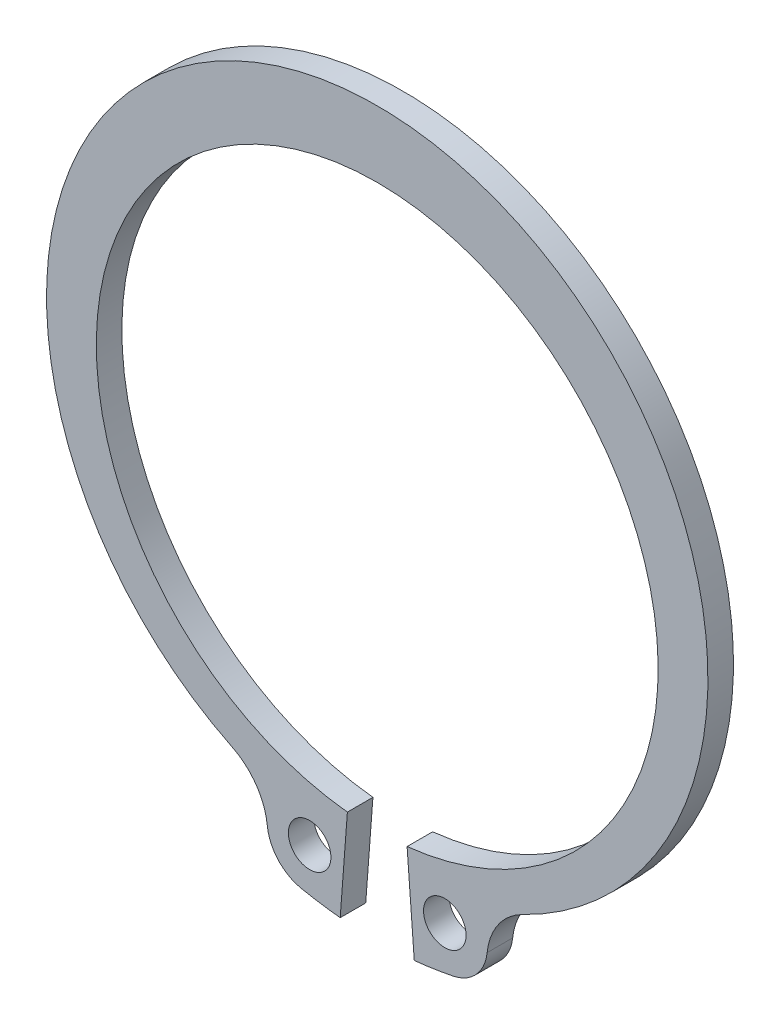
ISO-10303-21;
HEADER;
FILE_DESCRIPTION(('STEP AP214'),'2;1');
FILE_NAME('part.step','',(''),(''),'','','');
FILE_SCHEMA(('AUTOMOTIVE_DESIGN { 1 0 10303 214 1 1 1 1 }'));
ENDSEC;
DATA;
#1=APPLICATION_CONTEXT('core data for automotive mechanical design processes');
#2=APPLICATION_PROTOCOL_DEFINITION('international standard','automotive_design',2000,#1);
#3=PRODUCT_CONTEXT('',#1,'mechanical');
#4=PRODUCT('Part','Part','',(#3));
#5=PRODUCT_RELATED_PRODUCT_CATEGORY('part','',(#4));
#6=PRODUCT_DEFINITION_FORMATION('','',#4);
#7=PRODUCT_DEFINITION_CONTEXT('part definition',#1,'design');
#8=PRODUCT_DEFINITION('design','',#6,#7);
#9=PRODUCT_DEFINITION_SHAPE('','',#8);
#10=(LENGTH_UNIT() NAMED_UNIT(*) SI_UNIT(.MILLI.,.METRE.));
#11=(NAMED_UNIT(*) PLANE_ANGLE_UNIT() SI_UNIT($,.RADIAN.));
#12=(NAMED_UNIT(*) SI_UNIT($,.STERADIAN.) SOLID_ANGLE_UNIT());
#13=UNCERTAINTY_MEASURE_WITH_UNIT(LENGTH_MEASURE(1.E-05),#10,'distance_accuracy_value','');
#14=(GEOMETRIC_REPRESENTATION_CONTEXT(3) GLOBAL_UNCERTAINTY_ASSIGNED_CONTEXT((#13)) GLOBAL_UNIT_ASSIGNED_CONTEXT((#10,
#11,#12)) REPRESENTATION_CONTEXT('',''));
#15=CARTESIAN_POINT('',(0.,0.,0.));
#16=DIRECTION('',(0.,0.,1.));
#17=DIRECTION('',(1.,0.,0.));
#18=AXIS2_PLACEMENT_3D('',#15,#16,#17);
#19=CARTESIAN_POINT('',(0.,0.,1.5));
#20=DIRECTION('',(0.,0.,1.));
#21=DIRECTION('',(1.,0.,0.));
#22=AXIS2_PLACEMENT_3D('',#19,#20,#21);
#23=PLANE('',#22);
#24=CARTESIAN_POINT('',(-3.96952179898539,-19.1917649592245,1.5));
#25=DIRECTION('',(0.,0.,1.));
#26=DIRECTION('',(-1.,0.,0.));
#27=AXIS2_PLACEMENT_3D('',#24,#25,#26);
#28=CIRCLE('',#27,1.25);
#29=CARTESIAN_POINT('',(-5.21952179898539,-19.1917649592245,1.5));
#30=VERTEX_POINT('',#29);
#31=EDGE_CURVE('E145',#30,#30,#28,.T.);
#32=ORIENTED_EDGE('',*,*,#31,.F.);
#33=EDGE_LOOP('',(#32));
#34=FACE_BOUND('',#33,.T.);
#35=CARTESIAN_POINT('',(0.,0.,1.5));
#36=DIRECTION('',(0.,0.,-1.));
#37=DIRECTION('',(1.,0.,0.));
#38=AXIS2_PLACEMENT_3D('',#35,#36,#37);
#39=CIRCLE('',#38,16.5);
#40=CARTESIAN_POINT('',(-1.75340050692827,-16.4065714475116,1.5));
#41=VERTEX_POINT('',#40);
#42=CARTESIAN_POINT('',(1.75340050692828,-16.4065714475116,1.5));
#43=VERTEX_POINT('',#42);
#44=EDGE_CURVE('E160',#41,#43,#39,.T.);
#45=ORIENTED_EDGE('',*,*,#44,.T.);
#46=DIRECTION('',(0.075335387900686,-0.997158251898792,0.));
#47=VECTOR('',#46,1.);
#48=CARTESIAN_POINT('',(1.75340050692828,-16.4065714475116,1.5));
#49=LINE('',#48,#47);
#50=CARTESIAN_POINT('',(2.17527867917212,-21.9906576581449,1.5));
#51=VERTEX_POINT('',#50);
#52=EDGE_CURVE('E98',#43,#51,#49,.T.);
#53=ORIENTED_EDGE('',*,*,#52,.T.);
#54=CARTESIAN_POINT('',(0.,0.,1.5));
#55=DIRECTION('',(0.,0.,1.));
#56=DIRECTION('',(1.,0.,0.));
#57=AXIS2_PLACEMENT_3D('',#54,#55,#56);
#58=CIRCLE('',#57,22.0979832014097);
#59=CARTESIAN_POINT('',(4.47589045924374,-21.6399460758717,1.5));
#60=VERTEX_POINT('',#59);
#61=EDGE_CURVE('E181',#51,#60,#58,.T.);
#62=ORIENTED_EDGE('',*,*,#61,.T.);
#63=CARTESIAN_POINT('',(3.9695217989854,-19.1917649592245,1.5));
#64=DIRECTION('',(0.,0.,1.));
#65=DIRECTION('',(1.,0.,0.));
#66=AXIS2_PLACEMENT_3D('',#63,#64,#65);
#67=CIRCLE('',#66,2.5);
#68=CARTESIAN_POINT('',(6.45596941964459,-19.4517230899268,1.5));
#69=VERTEX_POINT('',#68);
#70=EDGE_CURVE('E200',#60,#69,#67,.T.);
#71=ORIENTED_EDGE('',*,*,#70,.T.);
#72=CARTESIAN_POINT('',(10.1856408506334,-19.8416602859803,1.5));
#73=DIRECTION('',(0.,0.,-1.));
#74=DIRECTION('',(1.,0.,0.));
#75=AXIS2_PLACEMENT_3D('',#72,#73,#74);
#76=CIRCLE('',#75,3.75);
#77=CARTESIAN_POINT('',(8.53747890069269,-16.4732686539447,1.5));
#78=VERTEX_POINT('',#77);
#79=EDGE_CURVE('E197',#69,#78,#76,.T.);
#80=ORIENTED_EDGE('',*,*,#79,.T.);
#81=CARTESIAN_POINT('',(0.,0.975,1.5));
#82=DIRECTION('',(0.,0.,1.));
#83=DIRECTION('',(1.,0.,0.));
#84=AXIS2_PLACEMENT_3D('',#81,#82,#83);
#85=CIRCLE('',#84,19.425);
#86=CARTESIAN_POINT('',(-8.53747890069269,-16.4732686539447,1.5));
#87=VERTEX_POINT('',#86);
#88=EDGE_CURVE('E199',#78,#87,#85,.T.);
#89=ORIENTED_EDGE('',*,*,#88,.T.);
#90=CARTESIAN_POINT('',(-10.1856408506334,-19.8416602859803,1.5));
#91=DIRECTION('',(0.,0.,-1.));
#92=DIRECTION('',(-1.,0.,0.));
#93=AXIS2_PLACEMENT_3D('',#90,#91,#92);
#94=CIRCLE('',#93,3.75);
#95=CARTESIAN_POINT('',(-6.45596941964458,-19.4517230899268,1.5));
#96=VERTEX_POINT('',#95);
#97=EDGE_CURVE('E123',#87,#96,#94,.T.);
#98=ORIENTED_EDGE('',*,*,#97,.T.);
#99=CARTESIAN_POINT('',(-3.96952179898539,-19.1917649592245,1.5));
#100=DIRECTION('',(0.,0.,1.));
#101=DIRECTION('',(-1.,0.,0.));
#102=AXIS2_PLACEMENT_3D('',#99,#100,#101);
#103=CIRCLE('',#102,2.5);
#104=CARTESIAN_POINT('',(-4.47589045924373,-21.6399460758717,1.5));
#105=VERTEX_POINT('',#104);
#106=EDGE_CURVE('E117',#96,#105,#103,.T.);
#107=ORIENTED_EDGE('',*,*,#106,.T.);
#108=CARTESIAN_POINT('',(0.,0.,1.5));
#109=DIRECTION('',(0.,0.,1.));
#110=DIRECTION('',(-1.,0.,0.));
#111=AXIS2_PLACEMENT_3D('',#108,#109,#110);
#112=CIRCLE('',#111,22.0979832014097);
#113=CARTESIAN_POINT('',(-2.17527867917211,-21.9906576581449,1.5));
#114=VERTEX_POINT('',#113);
#115=EDGE_CURVE('E121',#105,#114,#112,.T.);
#116=ORIENTED_EDGE('',*,*,#115,.T.);
#117=DIRECTION('',(0.0753353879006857,0.997158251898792,0.));
#118=VECTOR('',#117,1.);
#119=CARTESIAN_POINT('',(-1.75340050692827,-16.4065714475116,1.5));
#120=LINE('',#119,#118);
#121=EDGE_CURVE('E49',#114,#41,#120,.T.);
#122=ORIENTED_EDGE('',*,*,#121,.T.);
#123=EDGE_LOOP('',(#45,#53,#62,#71,#80,#89,#98,#107,#116,#122));
#124=FACE_BOUND('',#123,.T.);
#125=CARTESIAN_POINT('',(3.9695217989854,-19.1917649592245,1.5));
#126=DIRECTION('',(0.,0.,1.));
#127=DIRECTION('',(1.,0.,0.));
#128=AXIS2_PLACEMENT_3D('',#125,#126,#127);
#129=CIRCLE('',#128,1.25);
#130=CARTESIAN_POINT('',(5.2195217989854,-19.1917649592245,1.5));
#131=VERTEX_POINT('',#130);
#132=EDGE_CURVE('E211',#131,#131,#129,.T.);
#133=ORIENTED_EDGE('',*,*,#132,.F.);
#134=EDGE_LOOP('',(#133));
#135=FACE_BOUND('',#134,.T.);
#136=ADVANCED_FACE('F32',(#34,#124,#135),#23,.T.);
#137=CARTESIAN_POINT('',(0.,0.,0.));
#138=DIRECTION('',(0.,0.,1.));
#139=DIRECTION('',(1.,0.,0.));
#140=AXIS2_PLACEMENT_3D('',#137,#138,#139);
#141=PLANE('',#140);
#142=CARTESIAN_POINT('',(-3.96952179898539,-19.1917649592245,0.));
#143=DIRECTION('',(0.,0.,1.));
#144=DIRECTION('',(-1.,0.,0.));
#145=AXIS2_PLACEMENT_3D('',#142,#143,#144);
#146=CIRCLE('',#145,1.25);
#147=CARTESIAN_POINT('',(-5.21952179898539,-19.1917649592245,0.));
#148=VERTEX_POINT('',#147);
#149=EDGE_CURVE('E208',#148,#148,#146,.T.);
#150=ORIENTED_EDGE('',*,*,#149,.T.);
#151=EDGE_LOOP('',(#150));
#152=FACE_BOUND('',#151,.T.);
#153=CARTESIAN_POINT('',(0.,0.,0.));
#154=DIRECTION('',(0.,0.,-1.));
#155=DIRECTION('',(1.,0.,0.));
#156=AXIS2_PLACEMENT_3D('',#153,#154,#155);
#157=CIRCLE('',#156,16.5);
#158=CARTESIAN_POINT('',(-1.75340050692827,-16.4065714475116,0.));
#159=VERTEX_POINT('',#158);
#160=CARTESIAN_POINT('',(1.75340050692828,-16.4065714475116,0.));
#161=VERTEX_POINT('',#160);
#162=EDGE_CURVE('E141',#159,#161,#157,.T.);
#163=ORIENTED_EDGE('',*,*,#162,.F.);
#164=DIRECTION('',(0.0753353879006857,0.997158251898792,0.));
#165=VECTOR('',#164,1.);
#166=CARTESIAN_POINT('',(-1.75340050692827,-16.4065714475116,0.));
#167=LINE('',#166,#165);
#168=CARTESIAN_POINT('',(-2.17527867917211,-21.9906576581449,0.));
#169=VERTEX_POINT('',#168);
#170=EDGE_CURVE('E90',#169,#159,#167,.T.);
#171=ORIENTED_EDGE('',*,*,#170,.F.);
#172=CARTESIAN_POINT('',(0.,0.,0.));
#173=DIRECTION('',(0.,0.,1.));
#174=DIRECTION('',(-1.,0.,0.));
#175=AXIS2_PLACEMENT_3D('',#172,#173,#174);
#176=CIRCLE('',#175,22.0979832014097);
#177=CARTESIAN_POINT('',(-4.47589045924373,-21.6399460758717,0.));
#178=VERTEX_POINT('',#177);
#179=EDGE_CURVE('E84',#178,#169,#176,.T.);
#180=ORIENTED_EDGE('',*,*,#179,.F.);
#181=CARTESIAN_POINT('',(-3.96952179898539,-19.1917649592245,0.));
#182=DIRECTION('',(0.,0.,1.));
#183=DIRECTION('',(-1.,0.,0.));
#184=AXIS2_PLACEMENT_3D('',#181,#182,#183);
#185=CIRCLE('',#184,2.5);
#186=CARTESIAN_POINT('',(-6.45596941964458,-19.4517230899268,0.));
#187=VERTEX_POINT('',#186);
#188=EDGE_CURVE('E131',#187,#178,#185,.T.);
#189=ORIENTED_EDGE('',*,*,#188,.F.);
#190=CARTESIAN_POINT('',(-10.1856408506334,-19.8416602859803,0.));
#191=DIRECTION('',(0.,0.,-1.));
#192=DIRECTION('',(-1.,0.,0.));
#193=AXIS2_PLACEMENT_3D('',#190,#191,#192);
#194=CIRCLE('',#193,3.75);
#195=CARTESIAN_POINT('',(-8.53747890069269,-16.4732686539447,0.));
#196=VERTEX_POINT('',#195);
#197=EDGE_CURVE('E155',#196,#187,#194,.T.);
#198=ORIENTED_EDGE('',*,*,#197,.F.);
#199=CARTESIAN_POINT('',(0.,0.975,0.));
#200=DIRECTION('',(0.,0.,1.));
#201=DIRECTION('',(1.,0.,0.));
#202=AXIS2_PLACEMENT_3D('',#199,#200,#201);
#203=CIRCLE('',#202,19.425);
#204=CARTESIAN_POINT('',(8.53747890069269,-16.4732686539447,0.));
#205=VERTEX_POINT('',#204);
#206=EDGE_CURVE('E153',#205,#196,#203,.T.);
#207=ORIENTED_EDGE('',*,*,#206,.F.);
#208=CARTESIAN_POINT('',(10.1856408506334,-19.8416602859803,0.));
#209=DIRECTION('',(0.,0.,-1.));
#210=DIRECTION('',(1.,0.,0.));
#211=AXIS2_PLACEMENT_3D('',#208,#209,#210);
#212=CIRCLE('',#211,3.75);
#213=CARTESIAN_POINT('',(6.45596941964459,-19.4517230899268,0.));
#214=VERTEX_POINT('',#213);
#215=EDGE_CURVE('E151',#214,#205,#212,.T.);
#216=ORIENTED_EDGE('',*,*,#215,.F.);
#217=CARTESIAN_POINT('',(3.9695217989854,-19.1917649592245,0.));
#218=DIRECTION('',(0.,0.,1.));
#219=DIRECTION('',(1.,0.,0.));
#220=AXIS2_PLACEMENT_3D('',#217,#218,#219);
#221=CIRCLE('',#220,2.5);
#222=CARTESIAN_POINT('',(4.47589045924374,-21.6399460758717,0.));
#223=VERTEX_POINT('',#222);
#224=EDGE_CURVE('E149',#223,#214,#221,.T.);
#225=ORIENTED_EDGE('',*,*,#224,.F.);
#226=CARTESIAN_POINT('',(0.,0.,0.));
#227=DIRECTION('',(0.,0.,1.));
#228=DIRECTION('',(1.,0.,0.));
#229=AXIS2_PLACEMENT_3D('',#226,#227,#228);
#230=CIRCLE('',#229,22.0979832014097);
#231=CARTESIAN_POINT('',(2.17527867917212,-21.9906576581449,0.));
#232=VERTEX_POINT('',#231);
#233=EDGE_CURVE('E147',#232,#223,#230,.T.);
#234=ORIENTED_EDGE('',*,*,#233,.F.);
#235=DIRECTION('',(0.075335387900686,-0.997158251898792,0.));
#236=VECTOR('',#235,1.);
#237=CARTESIAN_POINT('',(1.75340050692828,-16.4065714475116,0.));
#238=LINE('',#237,#236);
#239=EDGE_CURVE('E144',#161,#232,#238,.T.);
#240=ORIENTED_EDGE('',*,*,#239,.F.);
#241=EDGE_LOOP('',(#163,#171,#180,#189,#198,#207,#216,#225,#234,#240));
#242=FACE_BOUND('',#241,.T.);
#243=CARTESIAN_POINT('',(3.9695217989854,-19.1917649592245,0.));
#244=DIRECTION('',(0.,0.,1.));
#245=DIRECTION('',(1.,0.,0.));
#246=AXIS2_PLACEMENT_3D('',#243,#244,#245);
#247=CIRCLE('',#246,1.25);
#248=CARTESIAN_POINT('',(5.2195217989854,-19.1917649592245,0.));
#249=VERTEX_POINT('',#248);
#250=EDGE_CURVE('E214',#249,#249,#247,.T.);
#251=ORIENTED_EDGE('',*,*,#250,.T.);
#252=EDGE_LOOP('',(#251));
#253=FACE_BOUND('',#252,.T.);
#254=ADVANCED_FACE('F185',(#152,#242,#253),#141,.F.);
#255=CARTESIAN_POINT('',(0.,0.,1.5));
#256=DIRECTION('',(0.,0.,-1.));
#257=DIRECTION('',(-1.,0.,0.));
#258=AXIS2_PLACEMENT_3D('',#255,#256,#257);
#259=CYLINDRICAL_SURFACE('',#258,16.5);
#260=ORIENTED_EDGE('',*,*,#162,.T.);
#261=DIRECTION('',(0.,0.,-1.));
#262=VECTOR('',#261,1.);
#263=CARTESIAN_POINT('',(1.75340050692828,-16.4065714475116,1.5));
#264=LINE('',#263,#262);
#265=EDGE_CURVE('E11',#43,#161,#264,.T.);
#266=ORIENTED_EDGE('',*,*,#265,.F.);
#267=ORIENTED_EDGE('',*,*,#44,.F.);
#268=DIRECTION('',(0.,0.,-1.));
#269=VECTOR('',#268,1.);
#270=CARTESIAN_POINT('',(-1.75340050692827,-16.4065714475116,1.5));
#271=LINE('',#270,#269);
#272=EDGE_CURVE('E137',#41,#159,#271,.T.);
#273=ORIENTED_EDGE('',*,*,#272,.T.);
#274=EDGE_LOOP('',(#260,#266,#267,#273));
#275=FACE_BOUND('',#274,.T.);
#276=ADVANCED_FACE('F34',(#275),#259,.F.);
#277=CARTESIAN_POINT('',(1.75340050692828,-16.4065714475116,1.5));
#278=DIRECTION('',(0.997158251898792,0.0753353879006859,0.));
#279=DIRECTION('',(-0.075335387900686,0.997158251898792,0.));
#280=AXIS2_PLACEMENT_3D('',#277,#278,#279);
#281=PLANE('',#280);
#282=ORIENTED_EDGE('',*,*,#239,.T.);
#283=DIRECTION('',(0.,0.,-1.));
#284=VECTOR('',#283,1.);
#285=CARTESIAN_POINT('',(2.17527867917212,-21.9906576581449,1.5));
#286=LINE('',#285,#284);
#287=EDGE_CURVE('E41',#51,#232,#286,.T.);
#288=ORIENTED_EDGE('',*,*,#287,.F.);
#289=ORIENTED_EDGE('',*,*,#52,.F.);
#290=ORIENTED_EDGE('',*,*,#265,.T.);
#291=EDGE_LOOP('',(#282,#288,#289,#290));
#292=FACE_BOUND('',#291,.T.);
#293=ADVANCED_FACE('F255',(#292),#281,.F.);
#294=CARTESIAN_POINT('',(0.,0.,1.5));
#295=DIRECTION('',(0.,0.,-1.));
#296=DIRECTION('',(-1.,0.,0.));
#297=AXIS2_PLACEMENT_3D('',#294,#295,#296);
#298=CYLINDRICAL_SURFACE('',#297,22.0979832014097);
#299=ORIENTED_EDGE('',*,*,#233,.T.);
#300=DIRECTION('',(0.,0.,-1.));
#301=VECTOR('',#300,1.);
#302=CARTESIAN_POINT('',(4.47589045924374,-21.6399460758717,1.5));
#303=LINE('',#302,#301);
#304=EDGE_CURVE('E173',#60,#223,#303,.T.);
#305=ORIENTED_EDGE('',*,*,#304,.F.);
#306=ORIENTED_EDGE('',*,*,#61,.F.);
#307=ORIENTED_EDGE('',*,*,#287,.T.);
#308=EDGE_LOOP('',(#299,#305,#306,#307));
#309=FACE_BOUND('',#308,.T.);
#310=ADVANCED_FACE('F179',(#309),#298,.T.);
#311=CARTESIAN_POINT('',(3.9695217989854,-19.1917649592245,1.5));
#312=DIRECTION('',(0.,0.,-1.));
#313=DIRECTION('',(-1.,0.,0.));
#314=AXIS2_PLACEMENT_3D('',#311,#312,#313);
#315=CYLINDRICAL_SURFACE('',#314,2.5);
#316=ORIENTED_EDGE('',*,*,#224,.T.);
#317=DIRECTION('',(0.,0.,-1.));
#318=VECTOR('',#317,1.);
#319=CARTESIAN_POINT('',(6.45596941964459,-19.4517230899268,1.5));
#320=LINE('',#319,#318);
#321=EDGE_CURVE('E170',#69,#214,#320,.T.);
#322=ORIENTED_EDGE('',*,*,#321,.F.);
#323=ORIENTED_EDGE('',*,*,#70,.F.);
#324=ORIENTED_EDGE('',*,*,#304,.T.);
#325=EDGE_LOOP('',(#316,#322,#323,#324));
#326=FACE_BOUND('',#325,.T.);
#327=ADVANCED_FACE('F191',(#326),#315,.T.);
#328=CARTESIAN_POINT('',(10.1856408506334,-19.8416602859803,1.5));
#329=DIRECTION('',(0.,0.,-1.));
#330=DIRECTION('',(-1.,0.,0.));
#331=AXIS2_PLACEMENT_3D('',#328,#329,#330);
#332=CYLINDRICAL_SURFACE('',#331,3.75);
#333=ORIENTED_EDGE('',*,*,#215,.T.);
#334=DIRECTION('',(0.,0.,-1.));
#335=VECTOR('',#334,1.);
#336=CARTESIAN_POINT('',(8.53747890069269,-16.4732686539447,1.5));
#337=LINE('',#336,#335);
#338=EDGE_CURVE('E167',#78,#205,#337,.T.);
#339=ORIENTED_EDGE('',*,*,#338,.F.);
#340=ORIENTED_EDGE('',*,*,#79,.F.);
#341=ORIENTED_EDGE('',*,*,#321,.T.);
#342=EDGE_LOOP('',(#333,#339,#340,#341));
#343=FACE_BOUND('',#342,.T.);
#344=ADVANCED_FACE('F195',(#343),#332,.F.);
#345=CARTESIAN_POINT('',(0.,0.975,1.5));
#346=DIRECTION('',(0.,0.,-1.));
#347=DIRECTION('',(-1.,0.,0.));
#348=AXIS2_PLACEMENT_3D('',#345,#346,#347);
#349=CYLINDRICAL_SURFACE('',#348,19.425);
#350=ORIENTED_EDGE('',*,*,#206,.T.);
#351=DIRECTION('',(0.,0.,-1.));
#352=VECTOR('',#351,1.);
#353=CARTESIAN_POINT('',(-8.53747890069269,-16.4732686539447,1.5));
#354=LINE('',#353,#352);
#355=EDGE_CURVE('E164',#87,#196,#354,.T.);
#356=ORIENTED_EDGE('',*,*,#355,.F.);
#357=ORIENTED_EDGE('',*,*,#88,.F.);
#358=ORIENTED_EDGE('',*,*,#338,.T.);
#359=EDGE_LOOP('',(#350,#356,#357,#358));
#360=FACE_BOUND('',#359,.T.);
#361=ADVANCED_FACE('F245',(#360),#349,.T.);
#362=CARTESIAN_POINT('',(-10.1856408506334,-19.8416602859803,1.5));
#363=DIRECTION('',(0.,0.,-1.));
#364=DIRECTION('',(-1.,0.,0.));
#365=AXIS2_PLACEMENT_3D('',#362,#363,#364);
#366=CYLINDRICAL_SURFACE('',#365,3.75);
#367=ORIENTED_EDGE('',*,*,#197,.T.);
#368=DIRECTION('',(0.,0.,-1.));
#369=VECTOR('',#368,1.);
#370=CARTESIAN_POINT('',(-6.45596941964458,-19.4517230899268,1.5));
#371=LINE('',#370,#369);
#372=EDGE_CURVE('E132',#96,#187,#371,.T.);
#373=ORIENTED_EDGE('',*,*,#372,.F.);
#374=ORIENTED_EDGE('',*,*,#97,.F.);
#375=ORIENTED_EDGE('',*,*,#355,.T.);
#376=EDGE_LOOP('',(#367,#373,#374,#375));
#377=FACE_BOUND('',#376,.T.);
#378=ADVANCED_FACE('F242',(#377),#366,.F.);
#379=CARTESIAN_POINT('',(-3.96952179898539,-19.1917649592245,1.5));
#380=DIRECTION('',(0.,0.,-1.));
#381=DIRECTION('',(-1.,0.,0.));
#382=AXIS2_PLACEMENT_3D('',#379,#380,#381);
#383=CYLINDRICAL_SURFACE('',#382,2.5);
#384=ORIENTED_EDGE('',*,*,#188,.T.);
#385=DIRECTION('',(0.,0.,-1.));
#386=VECTOR('',#385,1.);
#387=CARTESIAN_POINT('',(-4.47589045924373,-21.6399460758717,1.5));
#388=LINE('',#387,#386);
#389=EDGE_CURVE('E128',#105,#178,#388,.T.);
#390=ORIENTED_EDGE('',*,*,#389,.F.);
#391=ORIENTED_EDGE('',*,*,#106,.F.);
#392=ORIENTED_EDGE('',*,*,#372,.T.);
#393=EDGE_LOOP('',(#384,#390,#391,#392));
#394=FACE_BOUND('',#393,.T.);
#395=ADVANCED_FACE('F129',(#394),#383,.T.);
#396=CARTESIAN_POINT('',(0.,0.,1.5));
#397=DIRECTION('',(0.,0.,-1.));
#398=DIRECTION('',(-1.,0.,0.));
#399=AXIS2_PLACEMENT_3D('',#396,#397,#398);
#400=CYLINDRICAL_SURFACE('',#399,22.0979832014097);
#401=ORIENTED_EDGE('',*,*,#179,.T.);
#402=DIRECTION('',(0.,0.,-1.));
#403=VECTOR('',#402,1.);
#404=CARTESIAN_POINT('',(-2.17527867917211,-21.9906576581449,1.5));
#405=LINE('',#404,#403);
#406=EDGE_CURVE('E133',#114,#169,#405,.T.);
#407=ORIENTED_EDGE('',*,*,#406,.F.);
#408=ORIENTED_EDGE('',*,*,#115,.F.);
#409=ORIENTED_EDGE('',*,*,#389,.T.);
#410=EDGE_LOOP('',(#401,#407,#408,#409));
#411=FACE_BOUND('',#410,.T.);
#412=ADVANCED_FACE('F135',(#411),#400,.T.);
#413=CARTESIAN_POINT('',(-1.75340050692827,-16.4065714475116,1.5));
#414=DIRECTION('',(-0.997158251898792,0.0753353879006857,0.));
#415=DIRECTION('',(-0.0753353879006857,-0.997158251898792,0.));
#416=AXIS2_PLACEMENT_3D('',#413,#414,#415);
#417=PLANE('',#416);
#418=ORIENTED_EDGE('',*,*,#170,.T.);
#419=ORIENTED_EDGE('',*,*,#272,.F.);
#420=ORIENTED_EDGE('',*,*,#121,.F.);
#421=ORIENTED_EDGE('',*,*,#406,.T.);
#422=EDGE_LOOP('',(#418,#419,#420,#421));
#423=FACE_BOUND('',#422,.T.);
#424=ADVANCED_FACE('F235',(#423),#417,.F.);
#425=CARTESIAN_POINT('',(-3.96952179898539,-19.1917649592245,1.5));
#426=DIRECTION('',(0.,0.,-1.));
#427=DIRECTION('',(-1.,0.,0.));
#428=AXIS2_PLACEMENT_3D('',#425,#426,#427);
#429=CYLINDRICAL_SURFACE('',#428,1.25);
#430=ORIENTED_EDGE('',*,*,#31,.T.);
#431=EDGE_LOOP('',(#430));
#432=FACE_BOUND('',#431,.T.);
#433=ORIENTED_EDGE('',*,*,#149,.F.);
#434=EDGE_LOOP('',(#433));
#435=FACE_BOUND('',#434,.T.);
#436=ADVANCED_FACE('F232',(#432,#435),#429,.F.);
#437=CARTESIAN_POINT('',(3.9695217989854,-19.1917649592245,1.5));
#438=DIRECTION('',(0.,0.,-1.));
#439=DIRECTION('',(-1.,0.,0.));
#440=AXIS2_PLACEMENT_3D('',#437,#438,#439);
#441=CYLINDRICAL_SURFACE('',#440,1.25);
#442=ORIENTED_EDGE('',*,*,#132,.T.);
#443=EDGE_LOOP('',(#442));
#444=FACE_BOUND('',#443,.T.);
#445=ORIENTED_EDGE('',*,*,#250,.F.);
#446=EDGE_LOOP('',(#445));
#447=FACE_BOUND('',#446,.T.);
#448=ADVANCED_FACE('F220',(#444,#447),#441,.F.);
#449=CLOSED_SHELL('',(#136,#254,#276,#293,#310,#327,#344,#361,#378,#395,#412,#424,#436,#448));
#450=MANIFOLD_SOLID_BREP('B2',#449);
#451=ADVANCED_BREP_SHAPE_REPRESENTATION('',(#18,#450),#14);
#452=SHAPE_DEFINITION_REPRESENTATION(#9,#451);
ENDSEC;
END-ISO-10303-21;
